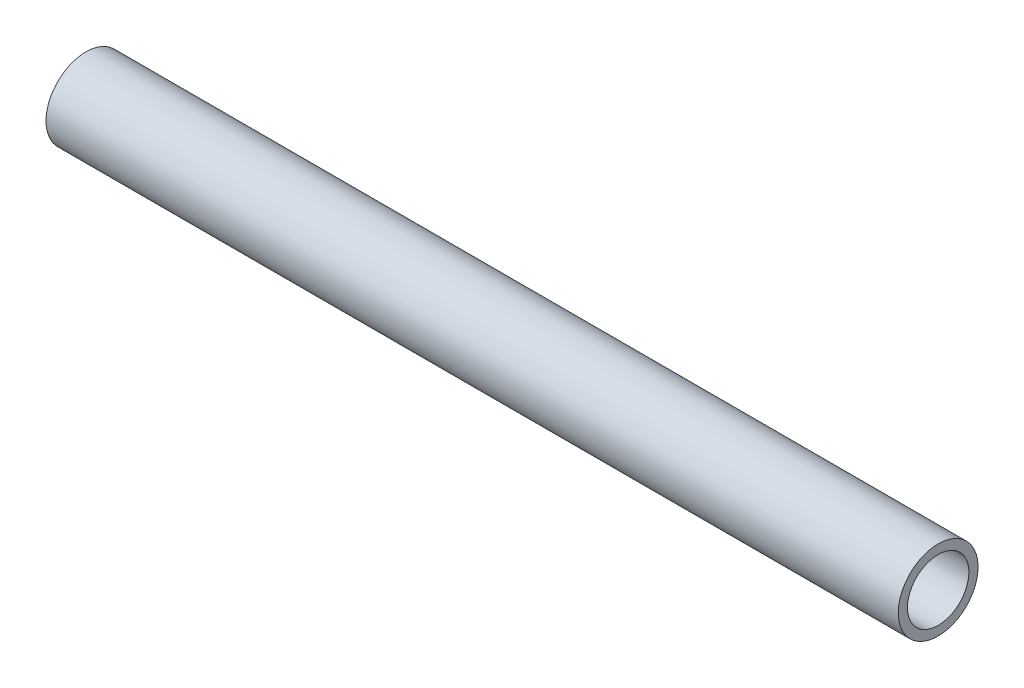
ISO-10303-21;
HEADER;
FILE_DESCRIPTION(('STEP AP214'),'2;1');
FILE_NAME('part.step','',(''),(''),'','','');
FILE_SCHEMA(('AUTOMOTIVE_DESIGN { 1 0 10303 214 1 1 1 1 }'));
ENDSEC;
DATA;
#1=APPLICATION_CONTEXT('core data for automotive mechanical design processes');
#2=APPLICATION_PROTOCOL_DEFINITION('international standard','automotive_design',2000,#1);
#3=PRODUCT_CONTEXT('',#1,'mechanical');
#4=PRODUCT('Part','Part','',(#3));
#5=PRODUCT_RELATED_PRODUCT_CATEGORY('part','',(#4));
#6=PRODUCT_DEFINITION_FORMATION('','',#4);
#7=PRODUCT_DEFINITION_CONTEXT('part definition',#1,'design');
#8=PRODUCT_DEFINITION('design','',#6,#7);
#9=PRODUCT_DEFINITION_SHAPE('','',#8);
#10=(LENGTH_UNIT() NAMED_UNIT(*) SI_UNIT(.MILLI.,.METRE.));
#11=(NAMED_UNIT(*) PLANE_ANGLE_UNIT() SI_UNIT($,.RADIAN.));
#12=(NAMED_UNIT(*) SI_UNIT($,.STERADIAN.) SOLID_ANGLE_UNIT());
#13=UNCERTAINTY_MEASURE_WITH_UNIT(LENGTH_MEASURE(1.E-05),#10,'distance_accuracy_value','');
#14=(GEOMETRIC_REPRESENTATION_CONTEXT(3) GLOBAL_UNCERTAINTY_ASSIGNED_CONTEXT((#13)) GLOBAL_UNIT_ASSIGNED_CONTEXT((#10,
#11,#12)) REPRESENTATION_CONTEXT('',''));
#15=CARTESIAN_POINT('',(0.,0.,0.));
#16=DIRECTION('',(0.,0.,1.));
#17=DIRECTION('',(1.,0.,0.));
#18=AXIS2_PLACEMENT_3D('',#15,#16,#17);
#19=CARTESIAN_POINT('',(352.425,0.,0.));
#20=DIRECTION('',(-1.,0.,0.));
#21=DIRECTION('',(0.,0.,1.));
#22=AXIS2_PLACEMENT_3D('',#19,#20,#21);
#23=CYLINDRICAL_SURFACE('',#22,12.7);
#24=CARTESIAN_POINT('',(352.425,0.,0.));
#25=DIRECTION('',(1.,0.,0.));
#26=DIRECTION('',(0.,0.,-1.));
#27=AXIS2_PLACEMENT_3D('',#24,#25,#26);
#28=CIRCLE('',#27,12.7);
#29=CARTESIAN_POINT('',(352.425,0.,12.7));
#30=VERTEX_POINT('',#29);
#31=EDGE_CURVE('E53',#30,#30,#28,.T.);
#32=CARTESIAN_POINT('',(0.,0.,0.));
#33=DIRECTION('',(1.,0.,0.));
#34=DIRECTION('',(0.,0.,-1.));
#35=AXIS2_PLACEMENT_3D('',#32,#33,#34);
#36=CIRCLE('',#35,12.7);
#37=CARTESIAN_POINT('',(0.,0.,12.7));
#38=VERTEX_POINT('',#37);
#39=EDGE_CURVE('E60',#38,#38,#36,.T.);
#40=CARTESIAN_POINT('',(352.425,0.,12.7));
#41=CARTESIAN_POINT('',(348.75390625,0.,12.7));
#42=CARTESIAN_POINT('',(345.0828125,0.,12.7));
#43=CARTESIAN_POINT('',(337.740625,0.,12.7));
#44=CARTESIAN_POINT('',(334.06953125,0.,12.7));
#45=CARTESIAN_POINT('',(326.72734375,0.,12.7));
#46=CARTESIAN_POINT('',(323.05625,0.,12.7));
#47=CARTESIAN_POINT('',(315.7140625,0.,12.7));
#48=CARTESIAN_POINT('',(312.04296875,0.,12.7));
#49=CARTESIAN_POINT('',(304.70078125,0.,12.7));
#50=CARTESIAN_POINT('',(301.0296875,0.,12.7));
#51=CARTESIAN_POINT('',(293.6875,0.,12.7));
#52=CARTESIAN_POINT('',(290.01640625,0.,12.7));
#53=CARTESIAN_POINT('',(282.67421875,0.,12.7));
#54=CARTESIAN_POINT('',(279.003125,0.,12.7));
#55=CARTESIAN_POINT('',(271.6609375,0.,12.7));
#56=CARTESIAN_POINT('',(267.98984375,0.,12.7));
#57=CARTESIAN_POINT('',(260.64765625,0.,12.7));
#58=CARTESIAN_POINT('',(256.9765625,0.,12.7));
#59=CARTESIAN_POINT('',(249.634375,0.,12.7));
#60=CARTESIAN_POINT('',(245.96328125,0.,12.7));
#61=CARTESIAN_POINT('',(238.62109375,0.,12.7));
#62=CARTESIAN_POINT('',(234.95,0.,12.7));
#63=CARTESIAN_POINT('',(227.6078125,0.,12.7));
#64=CARTESIAN_POINT('',(223.93671875,0.,12.7));
#65=CARTESIAN_POINT('',(216.59453125,0.,12.7));
#66=CARTESIAN_POINT('',(212.9234375,0.,12.7));
#67=CARTESIAN_POINT('',(205.58125,0.,12.7));
#68=CARTESIAN_POINT('',(201.91015625,0.,12.7));
#69=CARTESIAN_POINT('',(194.56796875,0.,12.7));
#70=CARTESIAN_POINT('',(190.896875,0.,12.7));
#71=CARTESIAN_POINT('',(183.5546875,0.,12.7));
#72=CARTESIAN_POINT('',(179.88359375,0.,12.7));
#73=CARTESIAN_POINT('',(172.54140625,0.,12.7));
#74=CARTESIAN_POINT('',(168.8703125,0.,12.7));
#75=CARTESIAN_POINT('',(161.528125,0.,12.7));
#76=CARTESIAN_POINT('',(157.85703125,0.,12.7));
#77=CARTESIAN_POINT('',(150.51484375,0.,12.7));
#78=CARTESIAN_POINT('',(146.84375,0.,12.7));
#79=CARTESIAN_POINT('',(139.5015625,0.,12.7));
#80=CARTESIAN_POINT('',(135.83046875,0.,12.7));
#81=CARTESIAN_POINT('',(128.48828125,0.,12.7));
#82=CARTESIAN_POINT('',(124.8171875,0.,12.7));
#83=CARTESIAN_POINT('',(117.475,0.,12.7));
#84=CARTESIAN_POINT('',(113.80390625,0.,12.7));
#85=CARTESIAN_POINT('',(106.46171875,0.,12.7));
#86=CARTESIAN_POINT('',(102.790625,0.,12.7));
#87=CARTESIAN_POINT('',(95.4484375,0.,12.7));
#88=CARTESIAN_POINT('',(91.77734375,0.,12.7));
#89=CARTESIAN_POINT('',(84.43515625,0.,12.7));
#90=CARTESIAN_POINT('',(80.7640625,0.,12.7));
#91=CARTESIAN_POINT('',(73.421875,0.,12.7));
#92=CARTESIAN_POINT('',(69.75078125,0.,12.7));
#93=CARTESIAN_POINT('',(62.40859375,0.,12.7));
#94=CARTESIAN_POINT('',(58.7375,0.,12.7));
#95=CARTESIAN_POINT('',(51.3953125,0.,12.7));
#96=CARTESIAN_POINT('',(47.72421875,0.,12.7));
#97=CARTESIAN_POINT('',(40.38203125,0.,12.7));
#98=CARTESIAN_POINT('',(36.7109375,0.,12.7));
#99=CARTESIAN_POINT('',(29.36875,0.,12.7));
#100=CARTESIAN_POINT('',(25.69765625,0.,12.7));
#101=CARTESIAN_POINT('',(18.35546875,0.,12.7));
#102=CARTESIAN_POINT('',(14.684375,0.,12.7));
#103=CARTESIAN_POINT('',(7.34218749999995,0.,12.7));
#104=CARTESIAN_POINT('',(3.67109374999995,0.,12.7));
#105=CARTESIAN_POINT('',(0.,0.,12.7));
#106=B_SPLINE_CURVE_WITH_KNOTS('',3,(#40,#41,#42,#43,#44,#45,#46,#47,#48,#49,#50,#51,#52,#53,
#54,#55,#56,#57,#58,#59,#60,#61,#62,#63,#64,#65,#66,#67,#68,#69,#70,#71,#72,#73,#74,#75,#76,#77,
#78,#79,#80,#81,#82,#83,#84,#85,#86,#87,#88,#89,#90,#91,#92,#93,#94,#95,#96,#97,#98,#99,#100,
#101,#102,#103,#104,#105),.UNSPECIFIED.,.F.,.F.,(4,2,2,2,2,2,2,2,2,2,2,2,2,2,2,2,2,2,2,2,2,2,2,
2,2,2,2,2,2,2,2,2,4),(0.,11.01328125,22.0265625,33.03984375,44.053125,55.06640625,66.0796875,
77.09296875,88.10625,99.1195312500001,110.1328125,121.14609375,132.159375,143.17265625,
154.1859375,165.19921875,176.2125,187.22578125,198.2390625,209.25234375,220.265625,231.27890625,
242.2921875,253.30546875,264.31875,275.33203125,286.3453125,297.35859375,308.371875,
319.38515625,330.3984375,341.41171875,352.425),.UNSPECIFIED.);
#107=EDGE_CURVE('BSEAM45',#30,#38,#106,.T.);
#108=ORIENTED_EDGE('',*,*,#31,.T.);
#109=ORIENTED_EDGE('',*,*,#39,.F.);
#110=ORIENTED_EDGE('',*,*,#107,.T.);
#111=ORIENTED_EDGE('',*,*,#107,.F.);
#112=EDGE_LOOP('',(#108,#110,#109,#111));
#113=FACE_BOUND('',#112,.T.);
#114=ADVANCED_FACE('F45',(#113),#23,.F.);
#115=CARTESIAN_POINT('',(352.425,0.,0.));
#116=DIRECTION('',(-1.,0.,0.));
#117=DIRECTION('',(0.,0.,1.));
#118=AXIS2_PLACEMENT_3D('',#115,#116,#117);
#119=CYLINDRICAL_SURFACE('',#118,16.51);
#120=CARTESIAN_POINT('',(352.425,0.,0.));
#121=DIRECTION('',(1.,0.,0.));
#122=DIRECTION('',(0.,0.,-1.));
#123=AXIS2_PLACEMENT_3D('',#120,#121,#122);
#124=CIRCLE('',#123,16.51);
#125=CARTESIAN_POINT('',(352.425,0.,16.51));
#126=VERTEX_POINT('',#125);
#127=EDGE_CURVE('E10',#126,#126,#124,.T.);
#128=CARTESIAN_POINT('',(0.,0.,0.));
#129=DIRECTION('',(1.,0.,0.));
#130=DIRECTION('',(0.,0.,-1.));
#131=AXIS2_PLACEMENT_3D('',#128,#129,#130);
#132=CIRCLE('',#131,16.51);
#133=CARTESIAN_POINT('',(0.,0.,16.51));
#134=VERTEX_POINT('',#133);
#135=EDGE_CURVE('E48',#134,#134,#132,.T.);
#136=CARTESIAN_POINT('',(352.425,0.,16.51));
#137=CARTESIAN_POINT('',(348.75390625,0.,16.51));
#138=CARTESIAN_POINT('',(345.0828125,0.,16.51));
#139=CARTESIAN_POINT('',(337.740625,0.,16.51));
#140=CARTESIAN_POINT('',(334.06953125,0.,16.51));
#141=CARTESIAN_POINT('',(326.72734375,0.,16.51));
#142=CARTESIAN_POINT('',(323.05625,0.,16.51));
#143=CARTESIAN_POINT('',(315.7140625,0.,16.51));
#144=CARTESIAN_POINT('',(312.04296875,0.,16.51));
#145=CARTESIAN_POINT('',(304.70078125,0.,16.51));
#146=CARTESIAN_POINT('',(301.0296875,0.,16.51));
#147=CARTESIAN_POINT('',(293.6875,0.,16.51));
#148=CARTESIAN_POINT('',(290.01640625,0.,16.51));
#149=CARTESIAN_POINT('',(282.67421875,0.,16.51));
#150=CARTESIAN_POINT('',(279.003125,0.,16.51));
#151=CARTESIAN_POINT('',(271.6609375,0.,16.51));
#152=CARTESIAN_POINT('',(267.98984375,0.,16.51));
#153=CARTESIAN_POINT('',(260.64765625,0.,16.51));
#154=CARTESIAN_POINT('',(256.9765625,0.,16.51));
#155=CARTESIAN_POINT('',(249.634375,0.,16.51));
#156=CARTESIAN_POINT('',(245.96328125,0.,16.51));
#157=CARTESIAN_POINT('',(238.62109375,0.,16.51));
#158=CARTESIAN_POINT('',(234.95,0.,16.51));
#159=CARTESIAN_POINT('',(227.6078125,0.,16.51));
#160=CARTESIAN_POINT('',(223.93671875,0.,16.51));
#161=CARTESIAN_POINT('',(216.59453125,0.,16.51));
#162=CARTESIAN_POINT('',(212.9234375,0.,16.51));
#163=CARTESIAN_POINT('',(205.58125,0.,16.51));
#164=CARTESIAN_POINT('',(201.91015625,0.,16.51));
#165=CARTESIAN_POINT('',(194.56796875,0.,16.51));
#166=CARTESIAN_POINT('',(190.896875,0.,16.51));
#167=CARTESIAN_POINT('',(183.5546875,0.,16.51));
#168=CARTESIAN_POINT('',(179.88359375,0.,16.51));
#169=CARTESIAN_POINT('',(172.54140625,0.,16.51));
#170=CARTESIAN_POINT('',(168.8703125,0.,16.51));
#171=CARTESIAN_POINT('',(161.528125,0.,16.51));
#172=CARTESIAN_POINT('',(157.85703125,0.,16.51));
#173=CARTESIAN_POINT('',(150.51484375,0.,16.51));
#174=CARTESIAN_POINT('',(146.84375,0.,16.51));
#175=CARTESIAN_POINT('',(139.5015625,0.,16.51));
#176=CARTESIAN_POINT('',(135.83046875,0.,16.51));
#177=CARTESIAN_POINT('',(128.48828125,0.,16.51));
#178=CARTESIAN_POINT('',(124.8171875,0.,16.51));
#179=CARTESIAN_POINT('',(117.475,0.,16.51));
#180=CARTESIAN_POINT('',(113.80390625,0.,16.51));
#181=CARTESIAN_POINT('',(106.46171875,0.,16.51));
#182=CARTESIAN_POINT('',(102.790625,0.,16.51));
#183=CARTESIAN_POINT('',(95.4484375,0.,16.51));
#184=CARTESIAN_POINT('',(91.77734375,0.,16.51));
#185=CARTESIAN_POINT('',(84.43515625,0.,16.51));
#186=CARTESIAN_POINT('',(80.7640625,0.,16.51));
#187=CARTESIAN_POINT('',(73.421875,0.,16.51));
#188=CARTESIAN_POINT('',(69.75078125,0.,16.51));
#189=CARTESIAN_POINT('',(62.40859375,0.,16.51));
#190=CARTESIAN_POINT('',(58.7375,0.,16.51));
#191=CARTESIAN_POINT('',(51.3953125,0.,16.51));
#192=CARTESIAN_POINT('',(47.72421875,0.,16.51));
#193=CARTESIAN_POINT('',(40.38203125,0.,16.51));
#194=CARTESIAN_POINT('',(36.7109375,0.,16.51));
#195=CARTESIAN_POINT('',(29.36875,0.,16.51));
#196=CARTESIAN_POINT('',(25.69765625,0.,16.51));
#197=CARTESIAN_POINT('',(18.35546875,0.,16.51));
#198=CARTESIAN_POINT('',(14.684375,0.,16.51));
#199=CARTESIAN_POINT('',(7.34218749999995,0.,16.51));
#200=CARTESIAN_POINT('',(3.67109374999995,0.,16.51));
#201=CARTESIAN_POINT('',(0.,0.,16.51));
#202=B_SPLINE_CURVE_WITH_KNOTS('',3,(#136,#137,#138,#139,#140,#141,#142,#143,#144,#145,#146,
#147,#148,#149,#150,#151,#152,#153,#154,#155,#156,#157,#158,#159,#160,#161,#162,#163,#164,#165,
#166,#167,#168,#169,#170,#171,#172,#173,#174,#175,#176,#177,#178,#179,#180,#181,#182,#183,#184,
#185,#186,#187,#188,#189,#190,#191,#192,#193,#194,#195,#196,#197,#198,#199,#200,#201),
.UNSPECIFIED.,.F.,.F.,(4,2,2,2,2,2,2,2,2,2,2,2,2,2,2,2,2,2,2,2,2,2,2,2,2,2,2,2,2,2,2,2,4),(0.,
11.01328125,22.0265625,33.03984375,44.053125,55.06640625,66.0796875,77.09296875,88.10625,
99.1195312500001,110.1328125,121.14609375,132.159375,143.17265625,154.1859375,165.19921875,
176.2125,187.22578125,198.2390625,209.25234375,220.265625,231.27890625,242.2921875,253.30546875,
264.31875,275.33203125,286.3453125,297.35859375,308.371875,319.38515625,330.3984375,
341.41171875,352.425),.UNSPECIFIED.);
#203=EDGE_CURVE('BSEAM69',#126,#134,#202,.T.);
#204=ORIENTED_EDGE('',*,*,#127,.F.);
#205=ORIENTED_EDGE('',*,*,#135,.T.);
#206=ORIENTED_EDGE('',*,*,#203,.T.);
#207=ORIENTED_EDGE('',*,*,#203,.F.);
#208=EDGE_LOOP('',(#204,#206,#205,#207));
#209=FACE_BOUND('',#208,.T.);
#210=ADVANCED_FACE('F69',(#209),#119,.T.);
#211=CARTESIAN_POINT('',(352.425,0.,0.));
#212=DIRECTION('',(1.,0.,0.));
#213=DIRECTION('',(0.,0.,-1.));
#214=AXIS2_PLACEMENT_3D('',#211,#212,#213);
#215=PLANE('',#214);
#216=ORIENTED_EDGE('',*,*,#31,.F.);
#217=EDGE_LOOP('',(#216));
#218=FACE_BOUND('',#217,.T.);
#219=ORIENTED_EDGE('',*,*,#127,.T.);
#220=EDGE_LOOP('',(#219));
#221=FACE_BOUND('',#220,.T.);
#222=ADVANCED_FACE('F73',(#218,#221),#215,.T.);
#223=CARTESIAN_POINT('',(0.,0.,0.));
#224=DIRECTION('',(1.,0.,0.));
#225=DIRECTION('',(0.,0.,-1.));
#226=AXIS2_PLACEMENT_3D('',#223,#224,#225);
#227=PLANE('',#226);
#228=ORIENTED_EDGE('',*,*,#39,.T.);
#229=EDGE_LOOP('',(#228));
#230=FACE_BOUND('',#229,.T.);
#231=ORIENTED_EDGE('',*,*,#135,.F.);
#232=EDGE_LOOP('',(#231));
#233=FACE_BOUND('',#232,.T.);
#234=ADVANCED_FACE('F71',(#230,#233),#227,.F.);
#235=CLOSED_SHELL('',(#114,#210,#222,#234));
#236=MANIFOLD_SOLID_BREP('B2',#235);
#237=ADVANCED_BREP_SHAPE_REPRESENTATION('',(#18,#236),#14);
#238=SHAPE_DEFINITION_REPRESENTATION(#9,#237);
ENDSEC;
END-ISO-10303-21;
